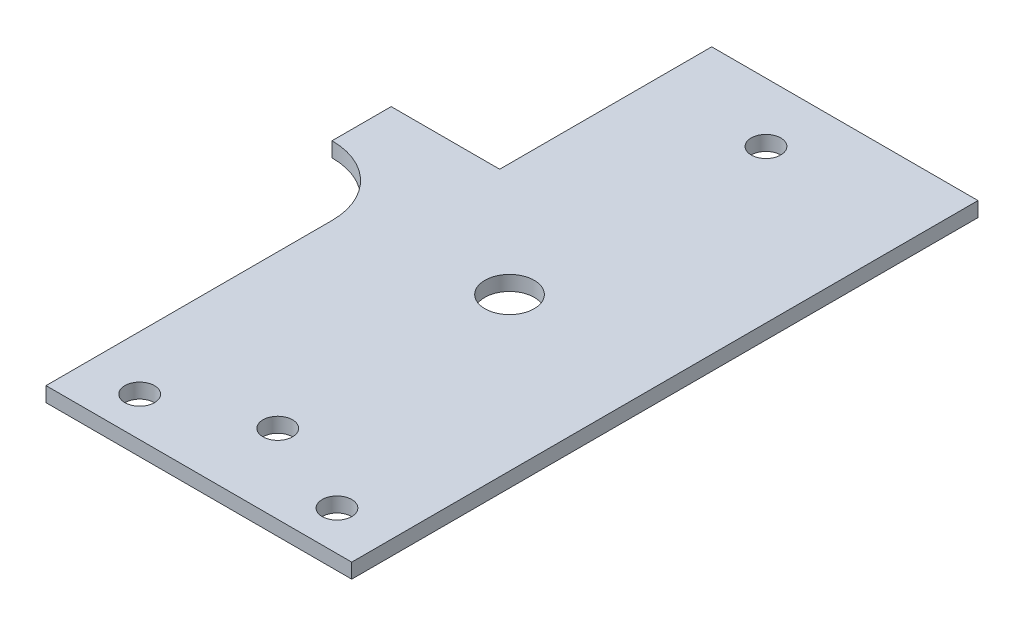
from build123d import *

# Parameters (mm, degrees)
SKETCH1_R      = 3
SKETCH1_R_2    = 5
EXTRUDE1_DEPTH = 3


with BuildPart() as part:
    # Sketch1 → Extrude1 (new body)
    with BuildSketch(Plane(origin=(0, 0, 0), x_dir=(1, 0, 0), z_dir=(0, 1, 0))):
        with BuildLine():
            Line((8, 127), (8, 84))
            Line((8, 84), (-14, 84))
            Line((-14, 84), (-14, 72))
            ThreePointArc((-14, 72), (-4.100505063, 67.899494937), (0, 58))
            Line((0, 58), (0, 0))
            Line((0, 0), (62, 0))
            Line((62, 0), (62, 127))
            Line((62, 127), (8, 127))
        make_face()
        with Locations(Location((31, 16, 0), (0, 0, 270))):
            Circle(SKETCH1_R, mode=Mode.SUBTRACT)
        with Locations(Location((51, 8, 0), (0, 0, 270))):
            Circle(SKETCH1_R, mode=Mode.SUBTRACT)
        with Locations(Location((11, 8, 0), (0, 0, 270))):
            Circle(SKETCH1_R, mode=Mode.SUBTRACT)
        with Locations(Location((31, 115, 0), (0, 0, 270))):
            Circle(SKETCH1_R, mode=Mode.SUBTRACT)
        with Locations(Location((31, 63, 0), (0, 0, 270))):
            Circle(SKETCH1_R_2, mode=Mode.SUBTRACT)
    extrude(amount=EXTRUDE1_DEPTH)


solid = part.part
